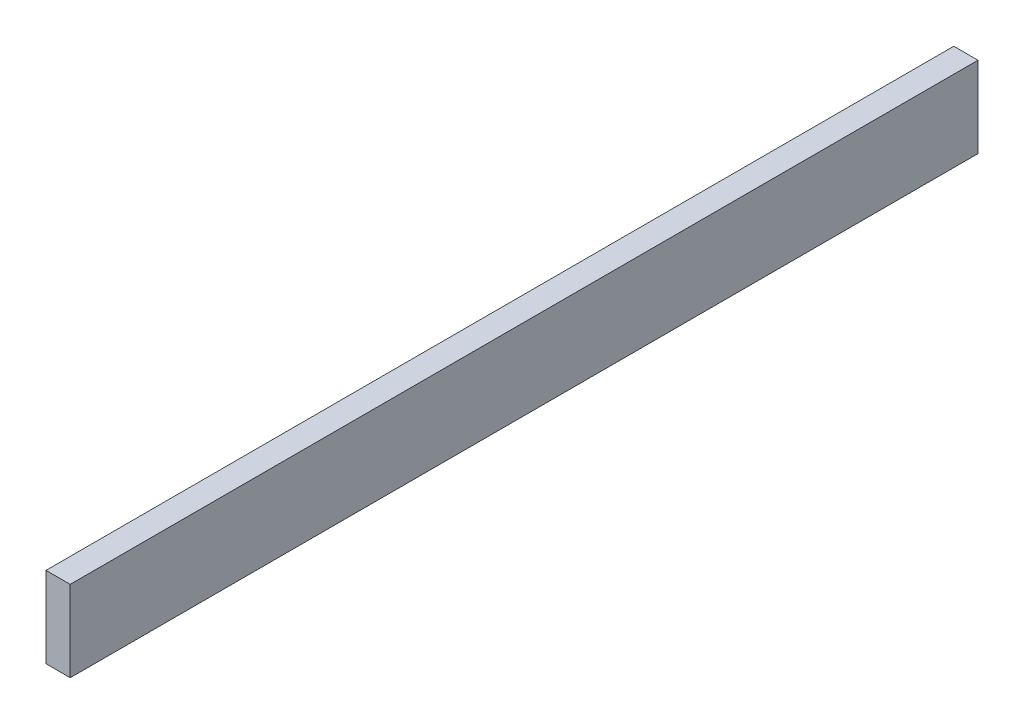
ISO-10303-21;
HEADER;
FILE_DESCRIPTION(('STEP AP214'),'2;1');
FILE_NAME('part.step','',(''),(''),'','','');
FILE_SCHEMA(('AUTOMOTIVE_DESIGN { 1 0 10303 214 1 1 1 1 }'));
ENDSEC;
DATA;
#1=APPLICATION_CONTEXT('core data for automotive mechanical design processes');
#2=APPLICATION_PROTOCOL_DEFINITION('international standard','automotive_design',2000,#1);
#3=PRODUCT_CONTEXT('',#1,'mechanical');
#4=PRODUCT('Part','Part','',(#3));
#5=PRODUCT_RELATED_PRODUCT_CATEGORY('part','',(#4));
#6=PRODUCT_DEFINITION_FORMATION('','',#4);
#7=PRODUCT_DEFINITION_CONTEXT('part definition',#1,'design');
#8=PRODUCT_DEFINITION('design','',#6,#7);
#9=PRODUCT_DEFINITION_SHAPE('','',#8);
#10=(LENGTH_UNIT() NAMED_UNIT(*) SI_UNIT(.MILLI.,.METRE.));
#11=(NAMED_UNIT(*) PLANE_ANGLE_UNIT() SI_UNIT($,.RADIAN.));
#12=(NAMED_UNIT(*) SI_UNIT($,.STERADIAN.) SOLID_ANGLE_UNIT());
#13=UNCERTAINTY_MEASURE_WITH_UNIT(LENGTH_MEASURE(1.E-05),#10,'distance_accuracy_value','');
#14=(GEOMETRIC_REPRESENTATION_CONTEXT(3) GLOBAL_UNCERTAINTY_ASSIGNED_CONTEXT((#13)) GLOBAL_UNIT_ASSIGNED_CONTEXT((#10,
#11,#12)) REPRESENTATION_CONTEXT('',''));
#15=CARTESIAN_POINT('',(0.,0.,0.));
#16=DIRECTION('',(0.,0.,1.));
#17=DIRECTION('',(1.,0.,0.));
#18=AXIS2_PLACEMENT_3D('',#15,#16,#17);
#19=CARTESIAN_POINT('',(12.,64.8032200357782,217.352415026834));
#20=DIRECTION('',(0.,0.,-1.));
#21=DIRECTION('',(0.,1.,0.));
#22=AXIS2_PLACEMENT_3D('',#19,#20,#21);
#23=PLANE('',#22);
#24=DIRECTION('',(0.,-1.,0.));
#25=VECTOR('',#24,1.);
#26=CARTESIAN_POINT('',(0.,64.8032200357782,217.352415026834));
#27=LINE('',#26,#25);
#28=CARTESIAN_POINT('',(0.,64.8032200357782,217.352415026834));
#29=VERTEX_POINT('',#28);
#30=CARTESIAN_POINT('',(0.,24.7032200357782,217.352415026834));
#31=VERTEX_POINT('',#30);
#32=EDGE_CURVE('E98',#29,#31,#27,.T.);
#33=ORIENTED_EDGE('',*,*,#32,.T.);
#34=DIRECTION('',(-1.,0.,0.));
#35=VECTOR('',#34,1.);
#36=CARTESIAN_POINT('',(12.,24.7032200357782,217.352415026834));
#37=LINE('',#36,#35);
#38=CARTESIAN_POINT('',(12.,24.7032200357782,217.352415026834));
#39=VERTEX_POINT('',#38);
#40=EDGE_CURVE('E11',#39,#31,#37,.T.);
#41=ORIENTED_EDGE('',*,*,#40,.F.);
#42=DIRECTION('',(0.,-1.,0.));
#43=VECTOR('',#42,1.);
#44=CARTESIAN_POINT('',(12.,64.8032200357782,217.352415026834));
#45=LINE('',#44,#43);
#46=CARTESIAN_POINT('',(12.,64.8032200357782,217.352415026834));
#47=VERTEX_POINT('',#46);
#48=EDGE_CURVE('E86',#47,#39,#45,.T.);
#49=ORIENTED_EDGE('',*,*,#48,.F.);
#50=DIRECTION('',(-1.,0.,0.));
#51=VECTOR('',#50,1.);
#52=CARTESIAN_POINT('',(12.,64.8032200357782,217.352415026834));
#53=LINE('',#52,#51);
#54=EDGE_CURVE('E94',#47,#29,#53,.T.);
#55=ORIENTED_EDGE('',*,*,#54,.T.);
#56=EDGE_LOOP('',(#33,#41,#49,#55));
#57=FACE_BOUND('',#56,.T.);
#58=ADVANCED_FACE('F35',(#57),#23,.F.);
#59=CARTESIAN_POINT('',(12.,24.7032200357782,217.352415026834));
#60=DIRECTION('',(0.,1.,0.));
#61=DIRECTION('',(0.,0.,1.));
#62=AXIS2_PLACEMENT_3D('',#59,#60,#61);
#63=PLANE('',#62);
#64=DIRECTION('',(0.,0.,-1.));
#65=VECTOR('',#64,1.);
#66=CARTESIAN_POINT('',(0.,24.7032200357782,217.352415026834));
#67=LINE('',#66,#65);
#68=CARTESIAN_POINT('',(0.,24.7032200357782,-232.647584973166));
#69=VERTEX_POINT('',#68);
#70=EDGE_CURVE('E90',#31,#69,#67,.T.);
#71=ORIENTED_EDGE('',*,*,#70,.T.);
#72=DIRECTION('',(-1.,0.,0.));
#73=VECTOR('',#72,1.);
#74=CARTESIAN_POINT('',(12.,24.7032200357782,-232.647584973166));
#75=LINE('',#74,#73);
#76=CARTESIAN_POINT('',(12.,24.7032200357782,-232.647584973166));
#77=VERTEX_POINT('',#76);
#78=EDGE_CURVE('E43',#77,#69,#75,.T.);
#79=ORIENTED_EDGE('',*,*,#78,.F.);
#80=DIRECTION('',(0.,0.,-1.));
#81=VECTOR('',#80,1.);
#82=CARTESIAN_POINT('',(12.,24.7032200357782,217.352415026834));
#83=LINE('',#82,#81);
#84=EDGE_CURVE('E81',#39,#77,#83,.T.);
#85=ORIENTED_EDGE('',*,*,#84,.F.);
#86=ORIENTED_EDGE('',*,*,#40,.T.);
#87=EDGE_LOOP('',(#71,#79,#85,#86));
#88=FACE_BOUND('',#87,.T.);
#89=ADVANCED_FACE('F89',(#88),#63,.F.);
#90=CARTESIAN_POINT('',(12.,64.8032200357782,-232.647584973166));
#91=DIRECTION('',(0.,0.,1.));
#92=DIRECTION('',(0.,-1.,0.));
#93=AXIS2_PLACEMENT_3D('',#90,#91,#92);
#94=PLANE('',#93);
#95=DIRECTION('',(0.,1.,0.));
#96=VECTOR('',#95,1.);
#97=CARTESIAN_POINT('',(0.,64.8032200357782,-232.647584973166));
#98=LINE('',#97,#96);
#99=CARTESIAN_POINT('',(0.,64.8032200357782,-232.647584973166));
#100=VERTEX_POINT('',#99);
#101=EDGE_CURVE('E68',#69,#100,#98,.T.);
#102=ORIENTED_EDGE('',*,*,#101,.T.);
#103=DIRECTION('',(-1.,0.,0.));
#104=VECTOR('',#103,1.);
#105=CARTESIAN_POINT('',(12.,64.8032200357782,-232.647584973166));
#106=LINE('',#105,#104);
#107=CARTESIAN_POINT('',(12.,64.8032200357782,-232.647584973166));
#108=VERTEX_POINT('',#107);
#109=EDGE_CURVE('E91',#108,#100,#106,.T.);
#110=ORIENTED_EDGE('',*,*,#109,.F.);
#111=DIRECTION('',(0.,1.,0.));
#112=VECTOR('',#111,1.);
#113=CARTESIAN_POINT('',(12.,64.8032200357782,-232.647584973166));
#114=LINE('',#113,#112);
#115=EDGE_CURVE('E84',#77,#108,#114,.T.);
#116=ORIENTED_EDGE('',*,*,#115,.F.);
#117=ORIENTED_EDGE('',*,*,#78,.T.);
#118=EDGE_LOOP('',(#102,#110,#116,#117));
#119=FACE_BOUND('',#118,.T.);
#120=ADVANCED_FACE('F92',(#119),#94,.F.);
#121=CARTESIAN_POINT('',(12.,64.8032200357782,217.352415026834));
#122=DIRECTION('',(0.,-1.,0.));
#123=DIRECTION('',(0.,0.,-1.));
#124=AXIS2_PLACEMENT_3D('',#121,#122,#123);
#125=PLANE('',#124);
#126=DIRECTION('',(0.,0.,1.));
#127=VECTOR('',#126,1.);
#128=CARTESIAN_POINT('',(0.,64.8032200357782,217.352415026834));
#129=LINE('',#128,#127);
#130=EDGE_CURVE('E74',#100,#29,#129,.T.);
#131=ORIENTED_EDGE('',*,*,#130,.T.);
#132=ORIENTED_EDGE('',*,*,#54,.F.);
#133=DIRECTION('',(0.,0.,1.));
#134=VECTOR('',#133,1.);
#135=CARTESIAN_POINT('',(12.,64.8032200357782,217.352415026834));
#136=LINE('',#135,#134);
#137=EDGE_CURVE('E51',#108,#47,#136,.T.);
#138=ORIENTED_EDGE('',*,*,#137,.F.);
#139=ORIENTED_EDGE('',*,*,#109,.T.);
#140=EDGE_LOOP('',(#131,#132,#138,#139));
#141=FACE_BOUND('',#140,.T.);
#142=ADVANCED_FACE('F105',(#141),#125,.F.);
#143=CARTESIAN_POINT('',(12.,0.,0.));
#144=DIRECTION('',(1.,0.,0.));
#145=DIRECTION('',(0.,0.,-1.));
#146=AXIS2_PLACEMENT_3D('',#143,#144,#145);
#147=PLANE('',#146);
#148=ORIENTED_EDGE('',*,*,#48,.T.);
#149=ORIENTED_EDGE('',*,*,#84,.T.);
#150=ORIENTED_EDGE('',*,*,#115,.T.);
#151=ORIENTED_EDGE('',*,*,#137,.T.);
#152=EDGE_LOOP('',(#148,#149,#150,#151));
#153=FACE_BOUND('',#152,.T.);
#154=ADVANCED_FACE('F82',(#153),#147,.T.);
#155=CARTESIAN_POINT('',(0.,0.,0.));
#156=DIRECTION('',(1.,0.,0.));
#157=DIRECTION('',(0.,0.,-1.));
#158=AXIS2_PLACEMENT_3D('',#155,#156,#157);
#159=PLANE('',#158);
#160=ORIENTED_EDGE('',*,*,#32,.F.);
#161=ORIENTED_EDGE('',*,*,#130,.F.);
#162=ORIENTED_EDGE('',*,*,#101,.F.);
#163=ORIENTED_EDGE('',*,*,#70,.F.);
#164=EDGE_LOOP('',(#160,#161,#162,#163));
#165=FACE_BOUND('',#164,.T.);
#166=ADVANCED_FACE('F108',(#165),#159,.F.);
#167=CLOSED_SHELL('',(#58,#89,#120,#142,#154,#166));
#168=MANIFOLD_SOLID_BREP('B2',#167);
#169=ADVANCED_BREP_SHAPE_REPRESENTATION('',(#18,#168),#14);
#170=SHAPE_DEFINITION_REPRESENTATION(#9,#169);
ENDSEC;
END-ISO-10303-21;
